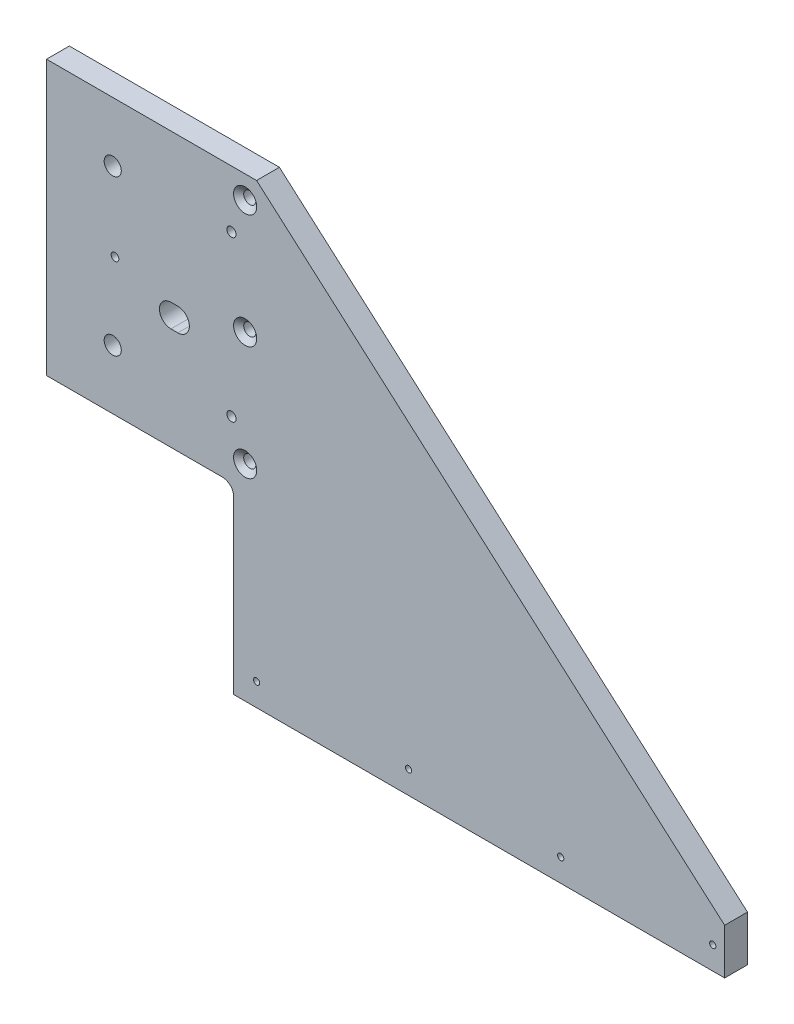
ISO-10303-21;
HEADER;
FILE_DESCRIPTION(('STEP AP214'),'2;1');
FILE_NAME('part.step','',(''),(''),'','','');
FILE_SCHEMA(('AUTOMOTIVE_DESIGN { 1 0 10303 214 1 1 1 1 }'));
ENDSEC;
DATA;
#1=APPLICATION_CONTEXT('core data for automotive mechanical design processes');
#2=APPLICATION_PROTOCOL_DEFINITION('international standard','automotive_design',2000,#1);
#3=PRODUCT_CONTEXT('',#1,'mechanical');
#4=PRODUCT('Part','Part','',(#3));
#5=PRODUCT_RELATED_PRODUCT_CATEGORY('part','',(#4));
#6=PRODUCT_DEFINITION_FORMATION('','',#4);
#7=PRODUCT_DEFINITION_CONTEXT('part definition',#1,'design');
#8=PRODUCT_DEFINITION('design','',#6,#7);
#9=PRODUCT_DEFINITION_SHAPE('','',#8);
#10=(LENGTH_UNIT() NAMED_UNIT(*) SI_UNIT(.MILLI.,.METRE.));
#11=(NAMED_UNIT(*) PLANE_ANGLE_UNIT() SI_UNIT($,.RADIAN.));
#12=(NAMED_UNIT(*) SI_UNIT($,.STERADIAN.) SOLID_ANGLE_UNIT());
#13=UNCERTAINTY_MEASURE_WITH_UNIT(LENGTH_MEASURE(1.E-05),#10,'distance_accuracy_value','');
#14=(GEOMETRIC_REPRESENTATION_CONTEXT(3) GLOBAL_UNCERTAINTY_ASSIGNED_CONTEXT((#13)) GLOBAL_UNIT_ASSIGNED_CONTEXT((#10,
#11,#12)) REPRESENTATION_CONTEXT('',''));
#15=CARTESIAN_POINT('',(0.,0.,0.));
#16=DIRECTION('',(0.,0.,1.));
#17=DIRECTION('',(1.,0.,0.));
#18=AXIS2_PLACEMENT_3D('',#15,#16,#17);
#19=CARTESIAN_POINT('',(0.,0.,12.7));
#20=DIRECTION('',(-1.,0.,0.));
#21=DIRECTION('',(0.,0.,1.));
#22=AXIS2_PLACEMENT_3D('',#19,#20,#21);
#23=PLANE('',#22);
#24=DIRECTION('',(0.,1.,0.));
#25=VECTOR('',#24,1.);
#26=CARTESIAN_POINT('',(0.,0.,0.));
#27=LINE('',#26,#25);
#28=CARTESIAN_POINT('',(0.,0.,0.));
#29=VERTEX_POINT('',#28);
#30=CARTESIAN_POINT('',(0.,25.4,0.));
#31=VERTEX_POINT('',#30);
#32=EDGE_CURVE('E179',#29,#31,#27,.T.);
#33=ORIENTED_EDGE('',*,*,#32,.T.);
#34=DIRECTION('',(0.,0.,-1.));
#35=VECTOR('',#34,1.);
#36=CARTESIAN_POINT('',(0.,25.4,12.7));
#37=LINE('',#36,#35);
#38=CARTESIAN_POINT('',(0.,25.4,12.7));
#39=VERTEX_POINT('',#38);
#40=EDGE_CURVE('E224',#39,#31,#37,.T.);
#41=ORIENTED_EDGE('',*,*,#40,.F.);
#42=DIRECTION('',(0.,1.,0.));
#43=VECTOR('',#42,1.);
#44=CARTESIAN_POINT('',(0.,0.,12.7));
#45=LINE('',#44,#43);
#46=CARTESIAN_POINT('',(0.,0.,12.7));
#47=VERTEX_POINT('',#46);
#48=EDGE_CURVE('E194',#47,#39,#45,.T.);
#49=ORIENTED_EDGE('',*,*,#48,.F.);
#50=DIRECTION('',(0.,0.,-1.));
#51=VECTOR('',#50,1.);
#52=CARTESIAN_POINT('',(0.,0.,12.7));
#53=LINE('',#52,#51);
#54=EDGE_CURVE('E209',#47,#29,#53,.T.);
#55=ORIENTED_EDGE('',*,*,#54,.T.);
#56=EDGE_LOOP('',(#33,#41,#49,#55));
#57=FACE_BOUND('',#56,.T.);
#58=ADVANCED_FACE('F36',(#57),#23,.F.);
#59=CARTESIAN_POINT('',(0.,25.4,12.7));
#60=DIRECTION('',(-0.659801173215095,-0.751440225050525,0.));
#61=DIRECTION('',(0.751440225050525,-0.659801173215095,0.));
#62=AXIS2_PLACEMENT_3D('',#59,#60,#61);
#63=PLANE('',#62);
#64=DIRECTION('',(-0.751440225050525,0.659801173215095,0.));
#65=VECTOR('',#64,1.);
#66=CARTESIAN_POINT('',(0.,25.4,0.));
#67=LINE('',#66,#65);
#68=CARTESIAN_POINT('',(-260.35,254.,0.));
#69=VERTEX_POINT('',#68);
#70=EDGE_CURVE('E182',#31,#69,#67,.T.);
#71=ORIENTED_EDGE('',*,*,#70,.T.);
#72=DIRECTION('',(0.,0.,-1.));
#73=VECTOR('',#72,1.);
#74=CARTESIAN_POINT('',(-260.35,254.,12.7));
#75=LINE('',#74,#73);
#76=CARTESIAN_POINT('',(-260.35,254.,12.7));
#77=VERTEX_POINT('',#76);
#78=EDGE_CURVE('E221',#77,#69,#75,.T.);
#79=ORIENTED_EDGE('',*,*,#78,.F.);
#80=DIRECTION('',(-0.751440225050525,0.659801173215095,0.));
#81=VECTOR('',#80,1.);
#82=CARTESIAN_POINT('',(0.,25.4,12.7));
#83=LINE('',#82,#81);
#84=EDGE_CURVE('E197',#39,#77,#83,.T.);
#85=ORIENTED_EDGE('',*,*,#84,.F.);
#86=ORIENTED_EDGE('',*,*,#40,.T.);
#87=EDGE_LOOP('',(#71,#79,#85,#86));
#88=FACE_BOUND('',#87,.T.);
#89=ADVANCED_FACE('F263',(#88),#63,.F.);
#90=CARTESIAN_POINT('',(-377.19,254.,12.7));
#91=DIRECTION('',(0.,-1.,0.));
#92=DIRECTION('',(1.,0.,0.));
#93=AXIS2_PLACEMENT_3D('',#90,#91,#92);
#94=PLANE('',#93);
#95=DIRECTION('',(-1.,0.,0.));
#96=VECTOR('',#95,1.);
#97=CARTESIAN_POINT('',(-377.19,254.,0.));
#98=LINE('',#97,#96);
#99=CARTESIAN_POINT('',(-377.19,254.,0.));
#100=VERTEX_POINT('',#99);
#101=EDGE_CURVE('E184',#69,#100,#98,.T.);
#102=ORIENTED_EDGE('',*,*,#101,.T.);
#103=DIRECTION('',(0.,0.,-1.));
#104=VECTOR('',#103,1.);
#105=CARTESIAN_POINT('',(-377.19,254.,12.7));
#106=LINE('',#105,#104);
#107=CARTESIAN_POINT('',(-377.19,254.,12.7));
#108=VERTEX_POINT('',#107);
#109=EDGE_CURVE('E218',#108,#100,#106,.T.);
#110=ORIENTED_EDGE('',*,*,#109,.F.);
#111=DIRECTION('',(-1.,0.,0.));
#112=VECTOR('',#111,1.);
#113=CARTESIAN_POINT('',(-377.19,254.,12.7));
#114=LINE('',#113,#112);
#115=EDGE_CURVE('E199',#77,#108,#114,.T.);
#116=ORIENTED_EDGE('',*,*,#115,.F.);
#117=ORIENTED_EDGE('',*,*,#78,.T.);
#118=EDGE_LOOP('',(#102,#110,#116,#117));
#119=FACE_BOUND('',#118,.T.);
#120=ADVANCED_FACE('F267',(#119),#94,.F.);
#121=CARTESIAN_POINT('',(-377.19,101.6,12.7));
#122=DIRECTION('',(1.,0.,0.));
#123=DIRECTION('',(0.,0.,-1.));
#124=AXIS2_PLACEMENT_3D('',#121,#122,#123);
#125=PLANE('',#124);
#126=DIRECTION('',(0.,-1.,0.));
#127=VECTOR('',#126,1.);
#128=CARTESIAN_POINT('',(-377.19,101.6,0.));
#129=LINE('',#128,#127);
#130=CARTESIAN_POINT('',(-377.19,101.6,0.));
#131=VERTEX_POINT('',#130);
#132=EDGE_CURVE('E186',#100,#131,#129,.T.);
#133=ORIENTED_EDGE('',*,*,#132,.T.);
#134=DIRECTION('',(0.,0.,-1.));
#135=VECTOR('',#134,1.);
#136=CARTESIAN_POINT('',(-377.19,101.6,12.7));
#137=LINE('',#136,#135);
#138=CARTESIAN_POINT('',(-377.19,101.6,12.7));
#139=VERTEX_POINT('',#138);
#140=EDGE_CURVE('E215',#139,#131,#137,.T.);
#141=ORIENTED_EDGE('',*,*,#140,.F.);
#142=DIRECTION('',(0.,-1.,0.));
#143=VECTOR('',#142,1.);
#144=CARTESIAN_POINT('',(-377.19,101.6,12.7));
#145=LINE('',#144,#143);
#146=EDGE_CURVE('E201',#108,#139,#145,.T.);
#147=ORIENTED_EDGE('',*,*,#146,.F.);
#148=ORIENTED_EDGE('',*,*,#109,.T.);
#149=EDGE_LOOP('',(#133,#141,#147,#148));
#150=FACE_BOUND('',#149,.T.);
#151=ADVANCED_FACE('F272',(#150),#125,.F.);
#152=CARTESIAN_POINT('',(-273.05,101.6,12.7));
#153=DIRECTION('',(0.,1.,0.));
#154=DIRECTION('',(-1.,0.,0.));
#155=AXIS2_PLACEMENT_3D('',#152,#153,#154);
#156=PLANE('',#155);
#157=DIRECTION('',(1.,0.,0.));
#158=VECTOR('',#157,1.);
#159=CARTESIAN_POINT('',(-273.05,101.6,0.));
#160=LINE('',#159,#158);
#161=CARTESIAN_POINT('',(-279.4,101.6,0.));
#162=VERTEX_POINT('',#161);
#163=EDGE_CURVE('E188',#131,#162,#160,.T.);
#164=ORIENTED_EDGE('',*,*,#163,.T.);
#165=DIRECTION('',(0.,0.,-1.));
#166=VECTOR('',#165,1.);
#167=CARTESIAN_POINT('',(-279.4,101.6,12.7));
#168=LINE('',#167,#166);
#169=CARTESIAN_POINT('',(-279.4,101.6,12.7));
#170=VERTEX_POINT('',#169);
#171=EDGE_CURVE('E50',#162,#170,#168,.F.);
#172=ORIENTED_EDGE('',*,*,#171,.T.);
#173=DIRECTION('',(1.,0.,0.));
#174=VECTOR('',#173,1.);
#175=CARTESIAN_POINT('',(-273.05,101.6,12.7));
#176=LINE('',#175,#174);
#177=EDGE_CURVE('E203',#139,#170,#176,.T.);
#178=ORIENTED_EDGE('',*,*,#177,.F.);
#179=ORIENTED_EDGE('',*,*,#140,.T.);
#180=EDGE_LOOP('',(#164,#172,#178,#179));
#181=FACE_BOUND('',#180,.T.);
#182=ADVANCED_FACE('F278',(#181),#156,.F.);
#183=CARTESIAN_POINT('',(-273.05,0.,12.7));
#184=DIRECTION('',(1.,0.,0.));
#185=DIRECTION('',(0.,0.,-1.));
#186=AXIS2_PLACEMENT_3D('',#183,#184,#185);
#187=PLANE('',#186);
#188=DIRECTION('',(0.,-1.,0.));
#189=VECTOR('',#188,1.);
#190=CARTESIAN_POINT('',(-273.05,0.,12.7));
#191=LINE('',#190,#189);
#192=CARTESIAN_POINT('',(-273.05,95.25,12.7));
#193=VERTEX_POINT('',#192);
#194=CARTESIAN_POINT('',(-273.05,0.,12.7));
#195=VERTEX_POINT('',#194);
#196=EDGE_CURVE('E205',#193,#195,#191,.T.);
#197=ORIENTED_EDGE('',*,*,#196,.F.);
#198=DIRECTION('',(0.,0.,-1.));
#199=VECTOR('',#198,1.);
#200=CARTESIAN_POINT('',(-273.05,95.25,0.));
#201=LINE('',#200,#199);
#202=CARTESIAN_POINT('',(-273.05,95.25,0.));
#203=VERTEX_POINT('',#202);
#204=EDGE_CURVE('E227',#193,#203,#201,.T.);
#205=ORIENTED_EDGE('',*,*,#204,.T.);
#206=DIRECTION('',(0.,-1.,0.));
#207=VECTOR('',#206,1.);
#208=CARTESIAN_POINT('',(-273.05,0.,0.));
#209=LINE('',#208,#207);
#210=CARTESIAN_POINT('',(-273.05,0.,0.));
#211=VERTEX_POINT('',#210);
#212=EDGE_CURVE('E190',#203,#211,#209,.T.);
#213=ORIENTED_EDGE('',*,*,#212,.T.);
#214=DIRECTION('',(0.,0.,-1.));
#215=VECTOR('',#214,1.);
#216=CARTESIAN_POINT('',(-273.05,0.,12.7));
#217=LINE('',#216,#215);
#218=EDGE_CURVE('E212',#195,#211,#217,.T.);
#219=ORIENTED_EDGE('',*,*,#218,.F.);
#220=EDGE_LOOP('',(#197,#205,#213,#219));
#221=FACE_BOUND('',#220,.T.);
#222=ADVANCED_FACE('F233',(#221),#187,.F.);
#223=CARTESIAN_POINT('',(0.,0.,12.7));
#224=DIRECTION('',(0.,1.,0.));
#225=DIRECTION('',(-1.,0.,0.));
#226=AXIS2_PLACEMENT_3D('',#223,#224,#225);
#227=PLANE('',#226);
#228=DIRECTION('',(1.,0.,0.));
#229=VECTOR('',#228,1.);
#230=CARTESIAN_POINT('',(0.,0.,0.));
#231=LINE('',#230,#229);
#232=EDGE_CURVE('E192',#211,#29,#231,.T.);
#233=ORIENTED_EDGE('',*,*,#232,.T.);
#234=ORIENTED_EDGE('',*,*,#54,.F.);
#235=DIRECTION('',(1.,0.,0.));
#236=VECTOR('',#235,1.);
#237=CARTESIAN_POINT('',(0.,0.,12.7));
#238=LINE('',#237,#236);
#239=EDGE_CURVE('E207',#195,#47,#238,.T.);
#240=ORIENTED_EDGE('',*,*,#239,.F.);
#241=ORIENTED_EDGE('',*,*,#218,.T.);
#242=EDGE_LOOP('',(#233,#234,#240,#241));
#243=FACE_BOUND('',#242,.T.);
#244=ADVANCED_FACE('F242',(#243),#227,.F.);
#245=CARTESIAN_POINT('',(0.,0.,12.7));
#246=DIRECTION('',(0.,0.,1.));
#247=DIRECTION('',(1.,0.,0.));
#248=AXIS2_PLACEMENT_3D('',#245,#246,#247);
#249=PLANE('',#248);
#250=CARTESIAN_POINT('',(-339.09,177.8,12.7));
#251=DIRECTION('',(0.,0.,1.));
#252=DIRECTION('',(1.,0.,0.));
#253=AXIS2_PLACEMENT_3D('',#250,#251,#252);
#254=CIRCLE('',#253,2.15264999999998);
#255=CARTESIAN_POINT('',(-336.93735,177.8,12.7));
#256=VERTEX_POINT('',#255);
#257=EDGE_CURVE('E379',#256,#256,#254,.T.);
#258=ORIENTED_EDGE('',*,*,#257,.F.);
#259=EDGE_LOOP('',(#258));
#260=FACE_BOUND('',#259,.T.);
#261=CARTESIAN_POINT('',(-266.7,241.3,12.7));
#262=DIRECTION('',(0.,0.,1.));
#263=DIRECTION('',(1.,0.,0.));
#264=AXIS2_PLACEMENT_3D('',#261,#262,#263);
#265=CIRCLE('',#264,6.43890000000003);
#266=CARTESIAN_POINT('',(-260.2611,241.3,12.7));
#267=VERTEX_POINT('',#266);
#268=EDGE_CURVE('E367',#267,#267,#265,.T.);
#269=ORIENTED_EDGE('',*,*,#268,.F.);
#270=EDGE_LOOP('',(#269));
#271=FACE_BOUND('',#270,.T.);
#272=CARTESIAN_POINT('',(-266.7,177.8,12.7));
#273=DIRECTION('',(0.,0.,1.));
#274=DIRECTION('',(1.,0.,0.));
#275=AXIS2_PLACEMENT_3D('',#272,#273,#274);
#276=CIRCLE('',#275,6.43890000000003);
#277=CARTESIAN_POINT('',(-260.2611,177.8,12.7));
#278=VERTEX_POINT('',#277);
#279=EDGE_CURVE('E358',#278,#278,#276,.T.);
#280=ORIENTED_EDGE('',*,*,#279,.F.);
#281=EDGE_LOOP('',(#280));
#282=FACE_BOUND('',#281,.T.);
#283=CARTESIAN_POINT('',(-266.7,114.3,12.7));
#284=DIRECTION('',(0.,0.,1.));
#285=DIRECTION('',(1.,0.,0.));
#286=AXIS2_PLACEMENT_3D('',#283,#284,#285);
#287=CIRCLE('',#286,6.43890000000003);
#288=CARTESIAN_POINT('',(-260.2611,114.3,12.7));
#289=VERTEX_POINT('',#288);
#290=EDGE_CURVE('E349',#289,#289,#287,.T.);
#291=ORIENTED_EDGE('',*,*,#290,.F.);
#292=EDGE_LOOP('',(#291));
#293=FACE_BOUND('',#292,.T.);
#294=CARTESIAN_POINT('',(-274.32,222.25,12.7));
#295=DIRECTION('',(0.,0.,1.));
#296=DIRECTION('',(1.,0.,0.));
#297=AXIS2_PLACEMENT_3D('',#294,#295,#296);
#298=CIRCLE('',#297,2.55269999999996);
#299=CARTESIAN_POINT('',(-271.7673,222.25,12.7));
#300=VERTEX_POINT('',#299);
#301=EDGE_CURVE('E343',#300,#300,#298,.T.);
#302=ORIENTED_EDGE('',*,*,#301,.F.);
#303=EDGE_LOOP('',(#302));
#304=FACE_BOUND('',#303,.T.);
#305=CARTESIAN_POINT('',(-274.32,133.35,12.7));
#306=DIRECTION('',(0.,0.,1.));
#307=DIRECTION('',(1.,0.,0.));
#308=AXIS2_PLACEMENT_3D('',#305,#306,#307);
#309=CIRCLE('',#308,2.55269999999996);
#310=CARTESIAN_POINT('',(-271.7673,133.35,12.7));
#311=VERTEX_POINT('',#310);
#312=EDGE_CURVE('E337',#311,#311,#309,.T.);
#313=ORIENTED_EDGE('',*,*,#312,.F.);
#314=EDGE_LOOP('',(#313));
#315=FACE_BOUND('',#314,.T.);
#316=CARTESIAN_POINT('',(-260.35,12.7,12.7));
#317=DIRECTION('',(0.,0.,1.));
#318=DIRECTION('',(1.,0.,0.));
#319=AXIS2_PLACEMENT_3D('',#316,#317,#318);
#320=CIRCLE('',#319,1.72719999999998);
#321=CARTESIAN_POINT('',(-258.6228,12.7,12.7));
#322=VERTEX_POINT('',#321);
#323=EDGE_CURVE('E331',#322,#322,#320,.T.);
#324=ORIENTED_EDGE('',*,*,#323,.F.);
#325=EDGE_LOOP('',(#324));
#326=FACE_BOUND('',#325,.T.);
#327=CARTESIAN_POINT('',(-175.768,12.7,12.7));
#328=DIRECTION('',(0.,0.,1.));
#329=DIRECTION('',(1.,0.,0.));
#330=AXIS2_PLACEMENT_3D('',#327,#328,#329);
#331=CIRCLE('',#330,1.72719999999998);
#332=CARTESIAN_POINT('',(-174.0408,12.7,12.7));
#333=VERTEX_POINT('',#332);
#334=EDGE_CURVE('E325',#333,#333,#331,.T.);
#335=ORIENTED_EDGE('',*,*,#334,.F.);
#336=EDGE_LOOP('',(#335));
#337=FACE_BOUND('',#336,.T.);
#338=CARTESIAN_POINT('',(-91.186,12.7,12.7));
#339=DIRECTION('',(0.,0.,1.));
#340=DIRECTION('',(1.,0.,0.));
#341=AXIS2_PLACEMENT_3D('',#338,#339,#340);
#342=CIRCLE('',#341,1.7272);
#343=CARTESIAN_POINT('',(-89.4588,12.7,12.7));
#344=VERTEX_POINT('',#343);
#345=EDGE_CURVE('E319',#344,#344,#342,.T.);
#346=ORIENTED_EDGE('',*,*,#345,.F.);
#347=EDGE_LOOP('',(#346));
#348=FACE_BOUND('',#347,.T.);
#349=CARTESIAN_POINT('',(-6.60400000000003,12.7,12.7));
#350=DIRECTION('',(0.,0.,1.));
#351=DIRECTION('',(1.,0.,0.));
#352=AXIS2_PLACEMENT_3D('',#349,#350,#351);
#353=CIRCLE('',#352,1.7272);
#354=CARTESIAN_POINT('',(-4.87680000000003,12.7,12.7));
#355=VERTEX_POINT('',#354);
#356=EDGE_CURVE('E312',#355,#355,#353,.T.);
#357=ORIENTED_EDGE('',*,*,#356,.F.);
#358=EDGE_LOOP('',(#357));
#359=FACE_BOUND('',#358,.T.);
#360=CARTESIAN_POINT('',(-307.975,165.1,12.7));
#361=DIRECTION('',(0.,0.,1.));
#362=DIRECTION('',(1.,0.,0.));
#363=AXIS2_PLACEMENT_3D('',#360,#361,#362);
#364=CIRCLE('',#363,6.41349999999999);
#365=CARTESIAN_POINT('',(-307.975,171.5135,12.7));
#366=VERTEX_POINT('',#365);
#367=CARTESIAN_POINT('',(-307.975,158.6865,12.7));
#368=VERTEX_POINT('',#367);
#369=EDGE_CURVE('E144',#366,#368,#364,.T.);
#370=ORIENTED_EDGE('',*,*,#369,.F.);
#371=DIRECTION('',(-1.,0.,0.));
#372=VECTOR('',#371,1.);
#373=CARTESIAN_POINT('',(-307.975,171.5135,12.7));
#374=LINE('',#373,#372);
#375=CARTESIAN_POINT('',(-304.165,171.5135,12.7));
#376=VERTEX_POINT('',#375);
#377=EDGE_CURVE('E149',#376,#366,#374,.T.);
#378=ORIENTED_EDGE('',*,*,#377,.F.);
#379=CARTESIAN_POINT('',(-304.165,165.1,12.7));
#380=DIRECTION('',(0.,0.,1.));
#381=DIRECTION('',(1.,0.,0.));
#382=AXIS2_PLACEMENT_3D('',#379,#380,#381);
#383=CIRCLE('',#382,6.41349999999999);
#384=CARTESIAN_POINT('',(-304.165,158.6865,12.7));
#385=VERTEX_POINT('',#384);
#386=EDGE_CURVE('E128',#385,#376,#383,.T.);
#387=ORIENTED_EDGE('',*,*,#386,.F.);
#388=DIRECTION('',(1.,0.,0.));
#389=VECTOR('',#388,1.);
#390=CARTESIAN_POINT('',(-304.165,158.6865,12.7));
#391=LINE('',#390,#389);
#392=EDGE_CURVE('E140',#368,#385,#391,.T.);
#393=ORIENTED_EDGE('',*,*,#392,.F.);
#394=EDGE_LOOP('',(#370,#378,#387,#393));
#395=FACE_BOUND('',#394,.T.);
#396=CARTESIAN_POINT('',(-340.36,220.98,12.7));
#397=DIRECTION('',(0.,0.,1.));
#398=DIRECTION('',(1.,0.,0.));
#399=AXIS2_PLACEMENT_3D('',#396,#397,#398);
#400=CIRCLE('',#399,4.76250000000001);
#401=CARTESIAN_POINT('',(-335.5975,220.98,12.7));
#402=VERTEX_POINT('',#401);
#403=EDGE_CURVE('E165',#402,#402,#400,.T.);
#404=ORIENTED_EDGE('',*,*,#403,.F.);
#405=EDGE_LOOP('',(#404));
#406=FACE_BOUND('',#405,.T.);
#407=CARTESIAN_POINT('',(-340.36,134.62,12.7));
#408=DIRECTION('',(0.,0.,1.));
#409=DIRECTION('',(1.,0.,0.));
#410=AXIS2_PLACEMENT_3D('',#407,#408,#409);
#411=CIRCLE('',#410,4.76250000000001);
#412=CARTESIAN_POINT('',(-335.5975,134.62,12.7));
#413=VERTEX_POINT('',#412);
#414=EDGE_CURVE('E173',#413,#413,#411,.T.);
#415=ORIENTED_EDGE('',*,*,#414,.F.);
#416=EDGE_LOOP('',(#415));
#417=FACE_BOUND('',#416,.T.);
#418=ORIENTED_EDGE('',*,*,#48,.T.);
#419=ORIENTED_EDGE('',*,*,#84,.T.);
#420=ORIENTED_EDGE('',*,*,#115,.T.);
#421=ORIENTED_EDGE('',*,*,#146,.T.);
#422=ORIENTED_EDGE('',*,*,#177,.T.);
#423=CARTESIAN_POINT('',(-279.4,95.25,12.7));
#424=DIRECTION('',(0.,0.,1.));
#425=DIRECTION('',(1.,0.,0.));
#426=AXIS2_PLACEMENT_3D('',#423,#424,#425);
#427=CIRCLE('',#426,6.35);
#428=EDGE_CURVE('E11',#170,#193,#427,.F.);
#429=ORIENTED_EDGE('',*,*,#428,.T.);
#430=ORIENTED_EDGE('',*,*,#196,.T.);
#431=ORIENTED_EDGE('',*,*,#239,.T.);
#432=EDGE_LOOP('',(#418,#419,#420,#421,#422,#429,#430,#431));
#433=FACE_BOUND('',#432,.T.);
#434=ADVANCED_FACE('F146',(#260,#271,#282,#293,#304,#315,#326,#337,#348,#359,#395,#406,#417,
#433),#249,.T.);
#435=CARTESIAN_POINT('',(0.,0.,0.));
#436=DIRECTION('',(0.,0.,1.));
#437=DIRECTION('',(1.,0.,0.));
#438=AXIS2_PLACEMENT_3D('',#435,#436,#437);
#439=PLANE('',#438);
#440=CARTESIAN_POINT('',(-339.09,177.8,0.));
#441=DIRECTION('',(0.,0.,1.));
#442=DIRECTION('',(1.,0.,0.));
#443=AXIS2_PLACEMENT_3D('',#440,#441,#442);
#444=CIRCLE('',#443,2.15264999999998);
#445=CARTESIAN_POINT('',(-336.93735,177.8,0.));
#446=VERTEX_POINT('',#445);
#447=EDGE_CURVE('E376',#446,#446,#444,.T.);
#448=ORIENTED_EDGE('',*,*,#447,.T.);
#449=EDGE_LOOP('',(#448));
#450=FACE_BOUND('',#449,.T.);
#451=CARTESIAN_POINT('',(-266.7,241.3,0.));
#452=DIRECTION('',(0.,0.,1.));
#453=DIRECTION('',(1.,0.,0.));
#454=AXIS2_PLACEMENT_3D('',#451,#452,#453);
#455=CIRCLE('',#454,3.3782);
#456=CARTESIAN_POINT('',(-263.3218,241.3,0.));
#457=VERTEX_POINT('',#456);
#458=EDGE_CURVE('E373',#457,#457,#455,.T.);
#459=ORIENTED_EDGE('',*,*,#458,.T.);
#460=EDGE_LOOP('',(#459));
#461=FACE_BOUND('',#460,.T.);
#462=CARTESIAN_POINT('',(-266.7,177.8,0.));
#463=DIRECTION('',(0.,0.,1.));
#464=DIRECTION('',(1.,0.,0.));
#465=AXIS2_PLACEMENT_3D('',#462,#463,#464);
#466=CIRCLE('',#465,3.3782);
#467=CARTESIAN_POINT('',(-263.3218,177.8,0.));
#468=VERTEX_POINT('',#467);
#469=EDGE_CURVE('E364',#468,#468,#466,.T.);
#470=ORIENTED_EDGE('',*,*,#469,.T.);
#471=EDGE_LOOP('',(#470));
#472=FACE_BOUND('',#471,.T.);
#473=CARTESIAN_POINT('',(-266.7,114.3,0.));
#474=DIRECTION('',(0.,0.,1.));
#475=DIRECTION('',(1.,0.,0.));
#476=AXIS2_PLACEMENT_3D('',#473,#474,#475);
#477=CIRCLE('',#476,3.3782);
#478=CARTESIAN_POINT('',(-263.3218,114.3,0.));
#479=VERTEX_POINT('',#478);
#480=EDGE_CURVE('E355',#479,#479,#477,.T.);
#481=ORIENTED_EDGE('',*,*,#480,.T.);
#482=EDGE_LOOP('',(#481));
#483=FACE_BOUND('',#482,.T.);
#484=CARTESIAN_POINT('',(-274.32,222.25,0.));
#485=DIRECTION('',(0.,0.,1.));
#486=DIRECTION('',(1.,0.,0.));
#487=AXIS2_PLACEMENT_3D('',#484,#485,#486);
#488=CIRCLE('',#487,2.55270000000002);
#489=CARTESIAN_POINT('',(-271.7673,222.25,0.));
#490=VERTEX_POINT('',#489);
#491=EDGE_CURVE('E346',#490,#490,#488,.T.);
#492=ORIENTED_EDGE('',*,*,#491,.T.);
#493=EDGE_LOOP('',(#492));
#494=FACE_BOUND('',#493,.T.);
#495=CARTESIAN_POINT('',(-274.32,133.35,0.));
#496=DIRECTION('',(0.,0.,1.));
#497=DIRECTION('',(1.,0.,0.));
#498=AXIS2_PLACEMENT_3D('',#495,#496,#497);
#499=CIRCLE('',#498,2.55270000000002);
#500=CARTESIAN_POINT('',(-271.7673,133.35,0.));
#501=VERTEX_POINT('',#500);
#502=EDGE_CURVE('E340',#501,#501,#499,.T.);
#503=ORIENTED_EDGE('',*,*,#502,.T.);
#504=EDGE_LOOP('',(#503));
#505=FACE_BOUND('',#504,.T.);
#506=CARTESIAN_POINT('',(-260.35,12.7,0.));
#507=DIRECTION('',(0.,0.,1.));
#508=DIRECTION('',(1.,0.,0.));
#509=AXIS2_PLACEMENT_3D('',#506,#507,#508);
#510=CIRCLE('',#509,1.72719999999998);
#511=CARTESIAN_POINT('',(-258.6228,12.7,0.));
#512=VERTEX_POINT('',#511);
#513=EDGE_CURVE('E334',#512,#512,#510,.T.);
#514=ORIENTED_EDGE('',*,*,#513,.T.);
#515=EDGE_LOOP('',(#514));
#516=FACE_BOUND('',#515,.T.);
#517=CARTESIAN_POINT('',(-175.768,12.7,0.));
#518=DIRECTION('',(0.,0.,1.));
#519=DIRECTION('',(1.,0.,0.));
#520=AXIS2_PLACEMENT_3D('',#517,#518,#519);
#521=CIRCLE('',#520,1.72719999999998);
#522=CARTESIAN_POINT('',(-174.0408,12.7,0.));
#523=VERTEX_POINT('',#522);
#524=EDGE_CURVE('E328',#523,#523,#521,.T.);
#525=ORIENTED_EDGE('',*,*,#524,.T.);
#526=EDGE_LOOP('',(#525));
#527=FACE_BOUND('',#526,.T.);
#528=CARTESIAN_POINT('',(-91.186,12.7,0.));
#529=DIRECTION('',(0.,0.,1.));
#530=DIRECTION('',(1.,0.,0.));
#531=AXIS2_PLACEMENT_3D('',#528,#529,#530);
#532=CIRCLE('',#531,1.7272);
#533=CARTESIAN_POINT('',(-89.4588,12.7,0.));
#534=VERTEX_POINT('',#533);
#535=EDGE_CURVE('E322',#534,#534,#532,.T.);
#536=ORIENTED_EDGE('',*,*,#535,.T.);
#537=EDGE_LOOP('',(#536));
#538=FACE_BOUND('',#537,.T.);
#539=CARTESIAN_POINT('',(-6.60400000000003,12.7,0.));
#540=DIRECTION('',(0.,0.,1.));
#541=DIRECTION('',(1.,0.,0.));
#542=AXIS2_PLACEMENT_3D('',#539,#540,#541);
#543=CIRCLE('',#542,1.7272);
#544=CARTESIAN_POINT('',(-4.87680000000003,12.7,0.));
#545=VERTEX_POINT('',#544);
#546=EDGE_CURVE('E314',#545,#545,#543,.T.);
#547=ORIENTED_EDGE('',*,*,#546,.T.);
#548=EDGE_LOOP('',(#547));
#549=FACE_BOUND('',#548,.T.);
#550=DIRECTION('',(-1.,0.,0.));
#551=VECTOR('',#550,1.);
#552=CARTESIAN_POINT('',(-307.975,171.5135,0.));
#553=LINE('',#552,#551);
#554=CARTESIAN_POINT('',(-304.165,171.5135,0.));
#555=VERTEX_POINT('',#554);
#556=CARTESIAN_POINT('',(-307.975,171.5135,0.));
#557=VERTEX_POINT('',#556);
#558=EDGE_CURVE('E160',#555,#557,#553,.T.);
#559=ORIENTED_EDGE('',*,*,#558,.T.);
#560=CARTESIAN_POINT('',(-307.975,165.1,0.));
#561=DIRECTION('',(0.,0.,1.));
#562=DIRECTION('',(1.,0.,0.));
#563=AXIS2_PLACEMENT_3D('',#560,#561,#562);
#564=CIRCLE('',#563,6.41349999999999);
#565=CARTESIAN_POINT('',(-307.975,158.6865,0.));
#566=VERTEX_POINT('',#565);
#567=EDGE_CURVE('E151',#557,#566,#564,.T.);
#568=ORIENTED_EDGE('',*,*,#567,.T.);
#569=DIRECTION('',(1.,0.,0.));
#570=VECTOR('',#569,1.);
#571=CARTESIAN_POINT('',(-304.165,158.6865,0.));
#572=LINE('',#571,#570);
#573=CARTESIAN_POINT('',(-304.165,158.6865,0.));
#574=VERTEX_POINT('',#573);
#575=EDGE_CURVE('E157',#566,#574,#572,.T.);
#576=ORIENTED_EDGE('',*,*,#575,.T.);
#577=CARTESIAN_POINT('',(-304.165,165.1,0.));
#578=DIRECTION('',(0.,0.,1.));
#579=DIRECTION('',(1.,0.,0.));
#580=AXIS2_PLACEMENT_3D('',#577,#578,#579);
#581=CIRCLE('',#580,6.41349999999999);
#582=EDGE_CURVE('E131',#574,#555,#581,.T.);
#583=ORIENTED_EDGE('',*,*,#582,.T.);
#584=EDGE_LOOP('',(#559,#568,#576,#583));
#585=FACE_BOUND('',#584,.T.);
#586=CARTESIAN_POINT('',(-340.36,220.98,0.));
#587=DIRECTION('',(0.,0.,1.));
#588=DIRECTION('',(1.,0.,0.));
#589=AXIS2_PLACEMENT_3D('',#586,#587,#588);
#590=CIRCLE('',#589,4.76250000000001);
#591=CARTESIAN_POINT('',(-335.5975,220.98,0.));
#592=VERTEX_POINT('',#591);
#593=EDGE_CURVE('E170',#592,#592,#590,.T.);
#594=ORIENTED_EDGE('',*,*,#593,.T.);
#595=EDGE_LOOP('',(#594));
#596=FACE_BOUND('',#595,.T.);
#597=CARTESIAN_POINT('',(-340.36,134.62,0.));
#598=DIRECTION('',(0.,0.,1.));
#599=DIRECTION('',(1.,0.,0.));
#600=AXIS2_PLACEMENT_3D('',#597,#598,#599);
#601=CIRCLE('',#600,4.76250000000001);
#602=CARTESIAN_POINT('',(-335.5975,134.62,0.));
#603=VERTEX_POINT('',#602);
#604=EDGE_CURVE('E176',#603,#603,#601,.T.);
#605=ORIENTED_EDGE('',*,*,#604,.T.);
#606=EDGE_LOOP('',(#605));
#607=FACE_BOUND('',#606,.T.);
#608=ORIENTED_EDGE('',*,*,#32,.F.);
#609=ORIENTED_EDGE('',*,*,#232,.F.);
#610=ORIENTED_EDGE('',*,*,#212,.F.);
#611=CARTESIAN_POINT('',(-279.4,95.25,0.));
#612=DIRECTION('',(0.,0.,1.));
#613=DIRECTION('',(1.,0.,0.));
#614=AXIS2_PLACEMENT_3D('',#611,#612,#613);
#615=CIRCLE('',#614,6.35);
#616=EDGE_CURVE('E43',#203,#162,#615,.T.);
#617=ORIENTED_EDGE('',*,*,#616,.T.);
#618=ORIENTED_EDGE('',*,*,#163,.F.);
#619=ORIENTED_EDGE('',*,*,#132,.F.);
#620=ORIENTED_EDGE('',*,*,#101,.F.);
#621=ORIENTED_EDGE('',*,*,#70,.F.);
#622=EDGE_LOOP('',(#608,#609,#610,#617,#618,#619,#620,#621));
#623=FACE_BOUND('',#622,.T.);
#624=ADVANCED_FACE('F239',(#450,#461,#472,#483,#494,#505,#516,#527,#538,#549,#585,#596,#607,
#623),#439,.F.);
#625=CARTESIAN_POINT('',(-340.36,134.62,0.));
#626=DIRECTION('',(0.,0.,1.));
#627=DIRECTION('',(1.,0.,0.));
#628=AXIS2_PLACEMENT_3D('',#625,#626,#627);
#629=CYLINDRICAL_SURFACE('',#628,4.76250000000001);
#630=ORIENTED_EDGE('',*,*,#604,.F.);
#631=EDGE_LOOP('',(#630));
#632=FACE_BOUND('',#631,.T.);
#633=ORIENTED_EDGE('',*,*,#414,.T.);
#634=EDGE_LOOP('',(#633));
#635=FACE_BOUND('',#634,.T.);
#636=ADVANCED_FACE('F291',(#632,#635),#629,.F.);
#637=CARTESIAN_POINT('',(-340.36,220.98,0.));
#638=DIRECTION('',(0.,0.,1.));
#639=DIRECTION('',(1.,0.,0.));
#640=AXIS2_PLACEMENT_3D('',#637,#638,#639);
#641=CYLINDRICAL_SURFACE('',#640,4.76250000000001);
#642=ORIENTED_EDGE('',*,*,#593,.F.);
#643=EDGE_LOOP('',(#642));
#644=FACE_BOUND('',#643,.T.);
#645=ORIENTED_EDGE('',*,*,#403,.T.);
#646=EDGE_LOOP('',(#645));
#647=FACE_BOUND('',#646,.T.);
#648=ADVANCED_FACE('F295',(#644,#647),#641,.F.);
#649=CARTESIAN_POINT('',(-307.975,165.1,0.));
#650=DIRECTION('',(0.,0.,1.));
#651=DIRECTION('',(1.,0.,0.));
#652=AXIS2_PLACEMENT_3D('',#649,#650,#651);
#653=CYLINDRICAL_SURFACE('',#652,6.41349999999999);
#654=ORIENTED_EDGE('',*,*,#369,.T.);
#655=DIRECTION('',(0.,0.,1.));
#656=VECTOR('',#655,1.);
#657=CARTESIAN_POINT('',(-307.975,158.6865,0.));
#658=LINE('',#657,#656);
#659=EDGE_CURVE('E136',#566,#368,#658,.T.);
#660=ORIENTED_EDGE('',*,*,#659,.F.);
#661=ORIENTED_EDGE('',*,*,#567,.F.);
#662=DIRECTION('',(0.,0.,1.));
#663=VECTOR('',#662,1.);
#664=CARTESIAN_POINT('',(-307.975,171.5135,0.));
#665=LINE('',#664,#663);
#666=EDGE_CURVE('E163',#557,#366,#665,.T.);
#667=ORIENTED_EDGE('',*,*,#666,.T.);
#668=EDGE_LOOP('',(#654,#660,#661,#667));
#669=FACE_BOUND('',#668,.T.);
#670=ADVANCED_FACE('F299',(#669),#653,.F.);
#671=CARTESIAN_POINT('',(-307.975,171.5135,0.));
#672=DIRECTION('',(0.,1.,0.));
#673=DIRECTION('',(0.,0.,1.));
#674=AXIS2_PLACEMENT_3D('',#671,#672,#673);
#675=PLANE('',#674);
#676=ORIENTED_EDGE('',*,*,#377,.T.);
#677=ORIENTED_EDGE('',*,*,#666,.F.);
#678=ORIENTED_EDGE('',*,*,#558,.F.);
#679=DIRECTION('',(0.,0.,1.));
#680=VECTOR('',#679,1.);
#681=CARTESIAN_POINT('',(-304.165,171.5135,0.));
#682=LINE('',#681,#680);
#683=EDGE_CURVE('E135',#555,#376,#682,.T.);
#684=ORIENTED_EDGE('',*,*,#683,.T.);
#685=EDGE_LOOP('',(#676,#677,#678,#684));
#686=FACE_BOUND('',#685,.T.);
#687=ADVANCED_FACE('F302',(#686),#675,.F.);
#688=CARTESIAN_POINT('',(-304.165,165.1,0.));
#689=DIRECTION('',(0.,0.,1.));
#690=DIRECTION('',(1.,0.,0.));
#691=AXIS2_PLACEMENT_3D('',#688,#689,#690);
#692=CYLINDRICAL_SURFACE('',#691,6.41349999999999);
#693=ORIENTED_EDGE('',*,*,#386,.T.);
#694=ORIENTED_EDGE('',*,*,#683,.F.);
#695=ORIENTED_EDGE('',*,*,#582,.F.);
#696=DIRECTION('',(0.,0.,1.));
#697=VECTOR('',#696,1.);
#698=CARTESIAN_POINT('',(-304.165,158.6865,0.));
#699=LINE('',#698,#697);
#700=EDGE_CURVE('E124',#574,#385,#699,.T.);
#701=ORIENTED_EDGE('',*,*,#700,.T.);
#702=EDGE_LOOP('',(#693,#694,#695,#701));
#703=FACE_BOUND('',#702,.T.);
#704=ADVANCED_FACE('F126',(#703),#692,.F.);
#705=CARTESIAN_POINT('',(-304.165,158.6865,0.));
#706=DIRECTION('',(0.,-1.,0.));
#707=DIRECTION('',(0.,0.,-1.));
#708=AXIS2_PLACEMENT_3D('',#705,#706,#707);
#709=PLANE('',#708);
#710=ORIENTED_EDGE('',*,*,#392,.T.);
#711=ORIENTED_EDGE('',*,*,#700,.F.);
#712=ORIENTED_EDGE('',*,*,#575,.F.);
#713=ORIENTED_EDGE('',*,*,#659,.T.);
#714=EDGE_LOOP('',(#710,#711,#712,#713));
#715=FACE_BOUND('',#714,.T.);
#716=ADVANCED_FACE('F141',(#715),#709,.F.);
#717=CARTESIAN_POINT('',(-279.4,95.25,12.7));
#718=DIRECTION('',(0.,0.,1.));
#719=DIRECTION('',(1.,0.,0.));
#720=AXIS2_PLACEMENT_3D('',#717,#718,#719);
#721=CYLINDRICAL_SURFACE('',#720,6.35);
#722=ORIENTED_EDGE('',*,*,#428,.F.);
#723=ORIENTED_EDGE('',*,*,#171,.F.);
#724=ORIENTED_EDGE('',*,*,#616,.F.);
#725=ORIENTED_EDGE('',*,*,#204,.F.);
#726=EDGE_LOOP('',(#722,#723,#724,#725));
#727=FACE_BOUND('',#726,.T.);
#728=ADVANCED_FACE('F249',(#727),#721,.F.);
#729=CARTESIAN_POINT('',(-6.60400000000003,12.7,12.7));
#730=DIRECTION('',(0.,0.,1.));
#731=DIRECTION('',(1.,0.,0.));
#732=AXIS2_PLACEMENT_3D('',#729,#730,#731);
#733=CYLINDRICAL_SURFACE('',#732,1.7272);
#734=ORIENTED_EDGE('',*,*,#546,.F.);
#735=EDGE_LOOP('',(#734));
#736=FACE_BOUND('',#735,.T.);
#737=ORIENTED_EDGE('',*,*,#356,.T.);
#738=EDGE_LOOP('',(#737));
#739=FACE_BOUND('',#738,.T.);
#740=ADVANCED_FACE('F251',(#736,#739),#733,.F.);
#741=CARTESIAN_POINT('',(-91.186,12.7,12.7));
#742=DIRECTION('',(0.,0.,1.));
#743=DIRECTION('',(1.,0.,0.));
#744=AXIS2_PLACEMENT_3D('',#741,#742,#743);
#745=CYLINDRICAL_SURFACE('',#744,1.7272);
#746=ORIENTED_EDGE('',*,*,#535,.F.);
#747=EDGE_LOOP('',(#746));
#748=FACE_BOUND('',#747,.T.);
#749=ORIENTED_EDGE('',*,*,#345,.T.);
#750=EDGE_LOOP('',(#749));
#751=FACE_BOUND('',#750,.T.);
#752=ADVANCED_FACE('F257',(#748,#751),#745,.F.);
#753=CARTESIAN_POINT('',(-175.768,12.7,12.7));
#754=DIRECTION('',(0.,0.,1.));
#755=DIRECTION('',(1.,0.,0.));
#756=AXIS2_PLACEMENT_3D('',#753,#754,#755);
#757=CYLINDRICAL_SURFACE('',#756,1.72719999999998);
#758=ORIENTED_EDGE('',*,*,#524,.F.);
#759=EDGE_LOOP('',(#758));
#760=FACE_BOUND('',#759,.T.);
#761=ORIENTED_EDGE('',*,*,#334,.T.);
#762=EDGE_LOOP('',(#761));
#763=FACE_BOUND('',#762,.T.);
#764=ADVANCED_FACE('F405',(#760,#763),#757,.F.);
#765=CARTESIAN_POINT('',(-260.35,12.7,12.7));
#766=DIRECTION('',(0.,0.,1.));
#767=DIRECTION('',(1.,0.,0.));
#768=AXIS2_PLACEMENT_3D('',#765,#766,#767);
#769=CYLINDRICAL_SURFACE('',#768,1.72719999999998);
#770=ORIENTED_EDGE('',*,*,#513,.F.);
#771=EDGE_LOOP('',(#770));
#772=FACE_BOUND('',#771,.T.);
#773=ORIENTED_EDGE('',*,*,#323,.T.);
#774=EDGE_LOOP('',(#773));
#775=FACE_BOUND('',#774,.T.);
#776=ADVANCED_FACE('F411',(#772,#775),#769,.F.);
#777=CARTESIAN_POINT('',(-274.32,133.35,12.7));
#778=DIRECTION('',(0.,0.,1.));
#779=DIRECTION('',(1.,0.,0.));
#780=AXIS2_PLACEMENT_3D('',#777,#778,#779);
#781=CYLINDRICAL_SURFACE('',#780,2.55269999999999);
#782=ORIENTED_EDGE('',*,*,#502,.F.);
#783=EDGE_LOOP('',(#782));
#784=FACE_BOUND('',#783,.T.);
#785=ORIENTED_EDGE('',*,*,#312,.T.);
#786=EDGE_LOOP('',(#785));
#787=FACE_BOUND('',#786,.T.);
#788=ADVANCED_FACE('F418',(#784,#787),#781,.F.);
#789=CARTESIAN_POINT('',(-274.32,222.25,12.7));
#790=DIRECTION('',(0.,0.,1.));
#791=DIRECTION('',(1.,0.,0.));
#792=AXIS2_PLACEMENT_3D('',#789,#790,#791);
#793=CYLINDRICAL_SURFACE('',#792,2.55269999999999);
#794=ORIENTED_EDGE('',*,*,#491,.F.);
#795=EDGE_LOOP('',(#794));
#796=FACE_BOUND('',#795,.T.);
#797=ORIENTED_EDGE('',*,*,#301,.T.);
#798=EDGE_LOOP('',(#797));
#799=FACE_BOUND('',#798,.T.);
#800=ADVANCED_FACE('F422',(#796,#799),#793,.F.);
#801=CARTESIAN_POINT('',(-266.7,114.3,12.7));
#802=DIRECTION('',(0.,0.,1.));
#803=DIRECTION('',(1.,0.,0.));
#804=AXIS2_PLACEMENT_3D('',#801,#802,#803);
#805=CONICAL_SURFACE('',#804,6.43890000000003,0.872664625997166);
#806=CARTESIAN_POINT('',(-266.7,114.3,10.1317677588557));
#807=DIRECTION('',(0.,0.,1.));
#808=DIRECTION('',(1.,0.,0.));
#809=AXIS2_PLACEMENT_3D('',#806,#807,#808);
#810=CIRCLE('',#809,3.3782);
#811=CARTESIAN_POINT('',(-263.3218,114.3,10.1317677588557));
#812=VERTEX_POINT('',#811);
#813=EDGE_CURVE('E352',#812,#812,#810,.T.);
#814=ORIENTED_EDGE('',*,*,#813,.F.);
#815=EDGE_LOOP('',(#814));
#816=FACE_BOUND('',#815,.T.);
#817=ORIENTED_EDGE('',*,*,#290,.T.);
#818=EDGE_LOOP('',(#817));
#819=FACE_BOUND('',#818,.T.);
#820=ADVANCED_FACE('F426',(#816,#819),#805,.F.);
#821=CARTESIAN_POINT('',(-266.7,114.3,12.7));
#822=DIRECTION('',(0.,0.,1.));
#823=DIRECTION('',(1.,0.,0.));
#824=AXIS2_PLACEMENT_3D('',#821,#822,#823);
#825=CYLINDRICAL_SURFACE('',#824,3.3782);
#826=ORIENTED_EDGE('',*,*,#480,.F.);
#827=EDGE_LOOP('',(#826));
#828=FACE_BOUND('',#827,.T.);
#829=ORIENTED_EDGE('',*,*,#813,.T.);
#830=EDGE_LOOP('',(#829));
#831=FACE_BOUND('',#830,.T.);
#832=ADVANCED_FACE('F430',(#828,#831),#825,.F.);
#833=CARTESIAN_POINT('',(-266.7,177.8,12.7));
#834=DIRECTION('',(0.,0.,1.));
#835=DIRECTION('',(1.,0.,0.));
#836=AXIS2_PLACEMENT_3D('',#833,#834,#835);
#837=CONICAL_SURFACE('',#836,6.43890000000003,0.872664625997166);
#838=CARTESIAN_POINT('',(-266.7,177.8,10.1317677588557));
#839=DIRECTION('',(0.,0.,1.));
#840=DIRECTION('',(1.,0.,0.));
#841=AXIS2_PLACEMENT_3D('',#838,#839,#840);
#842=CIRCLE('',#841,3.3782);
#843=CARTESIAN_POINT('',(-263.3218,177.8,10.1317677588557));
#844=VERTEX_POINT('',#843);
#845=EDGE_CURVE('E361',#844,#844,#842,.T.);
#846=ORIENTED_EDGE('',*,*,#845,.F.);
#847=EDGE_LOOP('',(#846));
#848=FACE_BOUND('',#847,.T.);
#849=ORIENTED_EDGE('',*,*,#279,.T.);
#850=EDGE_LOOP('',(#849));
#851=FACE_BOUND('',#850,.T.);
#852=ADVANCED_FACE('F434',(#848,#851),#837,.F.);
#853=CARTESIAN_POINT('',(-266.7,177.8,12.7));
#854=DIRECTION('',(0.,0.,1.));
#855=DIRECTION('',(1.,0.,0.));
#856=AXIS2_PLACEMENT_3D('',#853,#854,#855);
#857=CYLINDRICAL_SURFACE('',#856,3.3782);
#858=ORIENTED_EDGE('',*,*,#469,.F.);
#859=EDGE_LOOP('',(#858));
#860=FACE_BOUND('',#859,.T.);
#861=ORIENTED_EDGE('',*,*,#845,.T.);
#862=EDGE_LOOP('',(#861));
#863=FACE_BOUND('',#862,.T.);
#864=ADVANCED_FACE('F438',(#860,#863),#857,.F.);
#865=CARTESIAN_POINT('',(-266.7,241.3,12.7));
#866=DIRECTION('',(0.,0.,1.));
#867=DIRECTION('',(1.,0.,0.));
#868=AXIS2_PLACEMENT_3D('',#865,#866,#867);
#869=CONICAL_SURFACE('',#868,6.43890000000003,0.872664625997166);
#870=CARTESIAN_POINT('',(-266.7,241.3,10.1317677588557));
#871=DIRECTION('',(0.,0.,1.));
#872=DIRECTION('',(1.,0.,0.));
#873=AXIS2_PLACEMENT_3D('',#870,#871,#872);
#874=CIRCLE('',#873,3.3782);
#875=CARTESIAN_POINT('',(-263.3218,241.3,10.1317677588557));
#876=VERTEX_POINT('',#875);
#877=EDGE_CURVE('E370',#876,#876,#874,.T.);
#878=ORIENTED_EDGE('',*,*,#877,.F.);
#879=EDGE_LOOP('',(#878));
#880=FACE_BOUND('',#879,.T.);
#881=ORIENTED_EDGE('',*,*,#268,.T.);
#882=EDGE_LOOP('',(#881));
#883=FACE_BOUND('',#882,.T.);
#884=ADVANCED_FACE('F442',(#880,#883),#869,.F.);
#885=CARTESIAN_POINT('',(-266.7,241.3,12.7));
#886=DIRECTION('',(0.,0.,1.));
#887=DIRECTION('',(1.,0.,0.));
#888=AXIS2_PLACEMENT_3D('',#885,#886,#887);
#889=CYLINDRICAL_SURFACE('',#888,3.3782);
#890=ORIENTED_EDGE('',*,*,#458,.F.);
#891=EDGE_LOOP('',(#890));
#892=FACE_BOUND('',#891,.T.);
#893=ORIENTED_EDGE('',*,*,#877,.T.);
#894=EDGE_LOOP('',(#893));
#895=FACE_BOUND('',#894,.T.);
#896=ADVANCED_FACE('F446',(#892,#895),#889,.F.);
#897=CARTESIAN_POINT('',(-339.09,177.8,0.));
#898=DIRECTION('',(0.,0.,1.));
#899=DIRECTION('',(1.,0.,0.));
#900=AXIS2_PLACEMENT_3D('',#897,#898,#899);
#901=CYLINDRICAL_SURFACE('',#900,2.15264999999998);
#902=ORIENTED_EDGE('',*,*,#447,.F.);
#903=EDGE_LOOP('',(#902));
#904=FACE_BOUND('',#903,.T.);
#905=ORIENTED_EDGE('',*,*,#257,.T.);
#906=EDGE_LOOP('',(#905));
#907=FACE_BOUND('',#906,.T.);
#908=ADVANCED_FACE('F383',(#904,#907),#901,.F.);
#909=CLOSED_SHELL('',(#58,#89,#120,#151,#182,#222,#244,#434,#624,#636,#648,#670,#687,#704,#716,
#728,#740,#752,#764,#776,#788,#800,#820,#832,#852,#864,#884,#896,#908));
#910=MANIFOLD_SOLID_BREP('B2',#909);
#911=ADVANCED_BREP_SHAPE_REPRESENTATION('',(#18,#910),#14);
#912=SHAPE_DEFINITION_REPRESENTATION(#9,#911);
ENDSEC;
END-ISO-10303-21;
